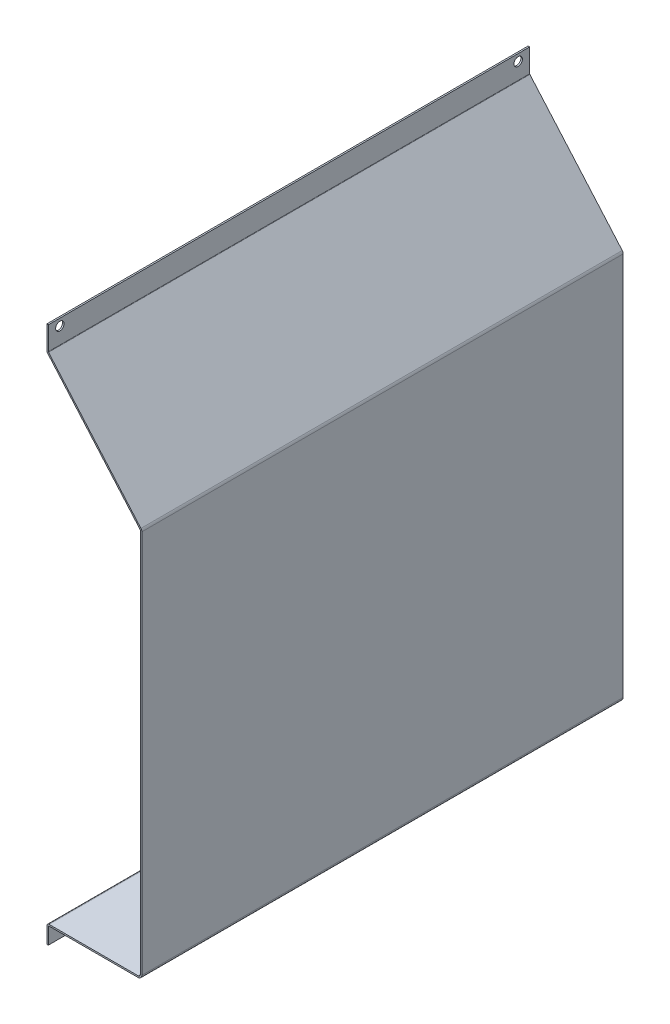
from build123d import *

# Parameters (mm, degrees)
EXTRUSION1_DEPTH        = 157
ESQUISSE2_R             = 2.75
ENL_V_MAT_EXTRU_1_DEPTH = 390.028597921


with BuildPart() as part:
    # Esquisse1 → Extrusion1 (new, symmetric)
    with BuildSketch(Plane.XY):
        with BuildLine():
            Line((0, 0), (0, 10.5))
            ThreePointArc((0, 10.5), (0.439339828, 11.560660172), (1.5, 12))
            Line((1.5, 12), (59.5, 12))
            ThreePointArc((59.5, 12), (60.560660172, 12.439339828), (61, 13.5))
            Line((61, 13.5), (61, 264.039172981))
            ThreePointArc((61, 264.039172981), (60.905008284, 264.564484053), (60.63206437, 265.023261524))
            Line((60.63206437, 265.023261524), (0.36793563, 334.349211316))
            ThreePointArc((0.36793563, 334.349211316), (0.094991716, 334.807988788), (0, 335.33329986))
            Line((0, 335.33329986), (0, 350.5))
            Line((0, 350.5), (1, 350.5))
            Line((1, 350.5), (1, 335.33329986))
            ThreePointArc((1, 335.33329986), (1.031663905, 335.158196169), (1.12264521, 335.005270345))
            Line((1.12264521, 335.005270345), (61.386773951, 265.679320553))
            ThreePointArc((61.386773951, 265.679320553), (61.841680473, 264.914691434), (62, 264.039172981))
            Line((62, 264.039172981), (62, 13.5))
            ThreePointArc((62, 13.5), (61.267766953, 11.732233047), (59.5, 11))
            Line((59.5, 11), (1.5, 11))
            ThreePointArc((1.5, 11), (1.146446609, 10.853553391), (1, 10.5))
            Line((1, 10.5), (1, 0))
            Line((1, 0), (0, 0))
        make_face()
    extrude(amount=EXTRUSION1_DEPTH, both=True)

    # Esquisse2 → Enl_v. mat.-Extru.1 (cut, through all)
    with BuildSketch(Plane.ZY):
        with Locations((-149.5, 346)):
            Circle(ESQUISSE2_R)
        with Locations(Location((149.5, 346, 0), (0, 0, 270))):
            Circle(ESQUISSE2_R)
        with Locations((0, 4.5)):
            Circle(ESQUISSE2_R)
    extrude(amount=-ENL_V_MAT_EXTRU_1_DEPTH, mode=Mode.SUBTRACT)


solid = part.part
